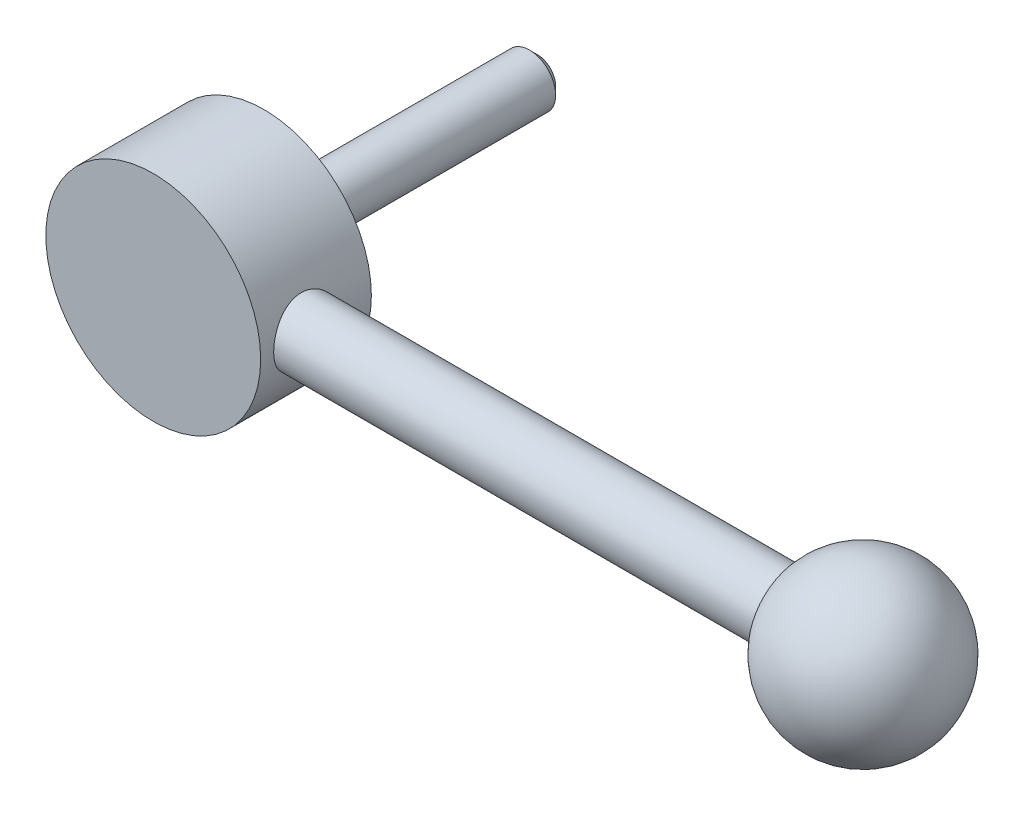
ISO-10303-21;
HEADER;
FILE_DESCRIPTION(('STEP AP214'),'2;1');
FILE_NAME('part.step','',(''),(''),'','','');
FILE_SCHEMA(('AUTOMOTIVE_DESIGN { 1 0 10303 214 1 1 1 1 }'));
ENDSEC;
DATA;
#1=APPLICATION_CONTEXT('core data for automotive mechanical design processes');
#2=APPLICATION_PROTOCOL_DEFINITION('international standard','automotive_design',2000,#1);
#3=PRODUCT_CONTEXT('',#1,'mechanical');
#4=PRODUCT('Part','Part','',(#3));
#5=PRODUCT_RELATED_PRODUCT_CATEGORY('part','',(#4));
#6=PRODUCT_DEFINITION_FORMATION('','',#4);
#7=PRODUCT_DEFINITION_CONTEXT('part definition',#1,'design');
#8=PRODUCT_DEFINITION('design','',#6,#7);
#9=PRODUCT_DEFINITION_SHAPE('','',#8);
#10=(LENGTH_UNIT() NAMED_UNIT(*) SI_UNIT(.MILLI.,.METRE.));
#11=(NAMED_UNIT(*) PLANE_ANGLE_UNIT() SI_UNIT($,.RADIAN.));
#12=(NAMED_UNIT(*) SI_UNIT($,.STERADIAN.) SOLID_ANGLE_UNIT());
#13=UNCERTAINTY_MEASURE_WITH_UNIT(LENGTH_MEASURE(1.E-05),#10,'distance_accuracy_value','');
#14=(GEOMETRIC_REPRESENTATION_CONTEXT(3) GLOBAL_UNCERTAINTY_ASSIGNED_CONTEXT((#13)) GLOBAL_UNIT_ASSIGNED_CONTEXT((#10,
#11,#12)) REPRESENTATION_CONTEXT('',''));
#15=CARTESIAN_POINT('',(0.,0.,0.));
#16=DIRECTION('',(0.,0.,1.));
#17=DIRECTION('',(1.,0.,0.));
#18=AXIS2_PLACEMENT_3D('',#15,#16,#17);
#19=CARTESIAN_POINT('',(0.,0.,40.));
#20=DIRECTION('',(0.,0.,1.));
#21=DIRECTION('',(1.,0.,0.));
#22=AXIS2_PLACEMENT_3D('',#19,#20,#21);
#23=CYLINDRICAL_SURFACE('',#22,6.75);
#24=CARTESIAN_POINT('',(0.,0.,2.));
#25=DIRECTION('',(0.,0.,1.));
#26=DIRECTION('',(1.,0.,0.));
#27=AXIS2_PLACEMENT_3D('',#24,#25,#26);
#28=CIRCLE('',#27,6.75);
#29=CARTESIAN_POINT('',(6.75,0.,2.));
#30=VERTEX_POINT('',#29);
#31=EDGE_CURVE('E23',#30,#30,#28,.T.);
#32=ORIENTED_EDGE('',*,*,#31,.F.);
#33=EDGE_LOOP('',(#32));
#34=FACE_BOUND('',#33,.T.);
#35=CARTESIAN_POINT('',(0.,0.,0.));
#36=DIRECTION('',(0.,0.,1.));
#37=DIRECTION('',(1.,0.,0.));
#38=AXIS2_PLACEMENT_3D('',#35,#36,#37);
#39=CIRCLE('',#38,6.75);
#40=CARTESIAN_POINT('',(6.75,0.,0.));
#41=VERTEX_POINT('',#40);
#42=EDGE_CURVE('E37',#41,#41,#39,.T.);
#43=ORIENTED_EDGE('',*,*,#42,.T.);
#44=EDGE_LOOP('',(#43));
#45=FACE_BOUND('',#44,.T.);
#46=ADVANCED_FACE('F12',(#34,#45),#23,.T.);
#47=CARTESIAN_POINT('',(6.75,0.,2.));
#48=DIRECTION('',(0.,0.,1.));
#49=DIRECTION('',(1.,0.,0.));
#50=AXIS2_PLACEMENT_3D('',#47,#48,#49);
#51=PLANE('',#50);
#52=CARTESIAN_POINT('',(0.,0.,2.));
#53=DIRECTION('',(0.,0.,1.));
#54=DIRECTION('',(1.,0.,0.));
#55=AXIS2_PLACEMENT_3D('',#52,#53,#54);
#56=CIRCLE('',#55,16.5);
#57=CARTESIAN_POINT('',(16.5,0.,2.));
#58=VERTEX_POINT('',#57);
#59=EDGE_CURVE('E27',#58,#58,#56,.T.);
#60=ORIENTED_EDGE('',*,*,#59,.F.);
#61=EDGE_LOOP('',(#60));
#62=FACE_BOUND('',#61,.T.);
#63=ORIENTED_EDGE('',*,*,#31,.T.);
#64=EDGE_LOOP('',(#63));
#65=FACE_BOUND('',#64,.T.);
#66=ADVANCED_FACE('F68',(#62,#65),#51,.F.);
#67=CARTESIAN_POINT('',(0.,0.,40.));
#68=DIRECTION('',(0.,0.,1.));
#69=DIRECTION('',(1.,0.,0.));
#70=AXIS2_PLACEMENT_3D('',#67,#68,#69);
#71=CYLINDRICAL_SURFACE('',#70,16.5);
#72=CARTESIAN_POINT('',(16.5,0.,7.));
#73=CARTESIAN_POINT('',(16.499997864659,-0.27416656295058,7.00000297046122));
#74=CARTESIAN_POINT('',(16.493101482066,-0.548363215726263,7.02262484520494));
#75=CARTESIAN_POINT('',(16.4662646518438,-1.08876356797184,7.11229452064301));
#76=CARTESIAN_POINT('',(16.446320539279,-1.35496499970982,7.17935480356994));
#77=CARTESIAN_POINT('',(16.3955720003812,-1.87150278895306,7.35545075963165));
#78=CARTESIAN_POINT('',(16.3647837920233,-2.12186218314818,7.4644237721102));
#79=CARTESIAN_POINT('',(16.2955420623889,-2.60075521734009,7.72099257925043));
#80=CARTESIAN_POINT('',(16.2570874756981,-2.82928581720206,7.86859374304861));
#81=CARTESIAN_POINT('',(16.1753529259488,-3.26471495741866,8.20277426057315));
#82=CARTESIAN_POINT('',(16.1319725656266,-3.47088543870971,8.39027763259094));
#83=CARTESIAN_POINT('',(16.0458704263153,-3.84938917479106,8.79697111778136));
#84=CARTESIAN_POINT('',(16.003148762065,-4.02171659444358,9.0161666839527));
#85=CARTESIAN_POINT('',(15.9221353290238,-4.33150150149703,9.48621682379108));
#86=CARTESIAN_POINT('',(15.8839681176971,-4.46806535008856,9.73768383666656));
#87=CARTESIAN_POINT('',(15.8178878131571,-4.69666762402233,10.2613575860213));
#88=CARTESIAN_POINT('',(15.7899722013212,-4.78871698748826,10.5335592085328));
#89=CARTESIAN_POINT('',(15.748602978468,-4.92304273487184,11.0827901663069));
#90=CARTESIAN_POINT('',(15.7347597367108,-4.96666335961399,11.3594605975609));
#91=CARTESIAN_POINT('',(15.7219440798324,-5.00709144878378,11.9165124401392));
#92=CARTESIAN_POINT('',(15.7229679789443,-5.00391051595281,12.1968929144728));
#93=CARTESIAN_POINT('',(15.7394259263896,-4.95188056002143,12.7424297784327));
#94=CARTESIAN_POINT('',(15.7543266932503,-4.90472150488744,13.0077661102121));
#95=CARTESIAN_POINT('',(15.7959958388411,-4.76880670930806,13.5265684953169));
#96=CARTESIAN_POINT('',(15.8227654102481,-4.68004678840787,13.7800333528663));
#97=CARTESIAN_POINT('',(15.8855774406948,-4.46221737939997,14.2720056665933));
#98=CARTESIAN_POINT('',(15.9217437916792,-4.33260397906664,14.5102558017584));
#99=CARTESIAN_POINT('',(15.9992154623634,-4.03712482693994,14.9621878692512));
#100=CARTESIAN_POINT('',(16.0405220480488,-3.87125013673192,15.1758637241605));
#101=CARTESIAN_POINT('',(16.125777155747,-3.49958783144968,15.5821595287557));
#102=CARTESIAN_POINT('',(16.1697632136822,-3.29239951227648,15.7734925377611));
#103=CARTESIAN_POINT('',(16.2538615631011,-2.84832978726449,16.1190003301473));
#104=CARTESIAN_POINT('',(16.2939736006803,-2.61144643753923,16.2731726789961));
#105=CARTESIAN_POINT('',(16.3661834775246,-2.11233821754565,16.540785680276));
#106=CARTESIAN_POINT('',(16.3982236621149,-1.84994861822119,16.6539357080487));
#107=CARTESIAN_POINT('',(16.4502641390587,-1.30866646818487,16.8341173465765));
#108=CARTESIAN_POINT('',(16.4702678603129,-1.02977864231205,16.9011620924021));
#109=CARTESIAN_POINT('',(16.4954369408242,-0.474353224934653,16.985075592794));
#110=CARTESIAN_POINT('',(16.5011177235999,-0.198102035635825,17.0036880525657));
#111=CARTESIAN_POINT('',(16.4985159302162,0.353597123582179,16.99510293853));
#112=CARTESIAN_POINT('',(16.4902352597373,0.629045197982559,16.9679116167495));
#113=CARTESIAN_POINT('',(16.4609787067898,1.16470330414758,16.869898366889));
#114=CARTESIAN_POINT('',(16.4403007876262,1.42511840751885,16.8000997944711));
#115=CARTESIAN_POINT('',(16.388649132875,1.93048096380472,16.6200887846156));
#116=CARTESIAN_POINT('',(16.3576741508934,2.17542653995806,16.5098714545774));
#117=CARTESIAN_POINT('',(16.2877277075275,2.64927766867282,16.2492534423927));
#118=CARTESIAN_POINT('',(16.2485858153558,2.87767261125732,16.097971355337));
#119=CARTESIAN_POINT('',(16.1667951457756,3.30642612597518,15.7605859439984));
#120=CARTESIAN_POINT('',(16.1241454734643,3.50677750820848,15.5744737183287));
#121=CARTESIAN_POINT('',(16.0381606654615,3.88146430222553,15.1645160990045));
#122=CARTESIAN_POINT('',(15.9948588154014,4.05455854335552,14.9395268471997));
#123=CARTESIAN_POINT('',(15.9141467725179,4.36062787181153,14.4627539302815));
#124=CARTESIAN_POINT('',(15.8767364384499,4.49360392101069,14.2109709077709));
#125=CARTESIAN_POINT('',(15.8124706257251,4.71477026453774,13.6884965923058));
#126=CARTESIAN_POINT('',(15.7855679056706,4.80316154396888,13.4178965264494));
#127=CARTESIAN_POINT('',(15.7455304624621,4.93284562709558,12.8646819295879));
#128=CARTESIAN_POINT('',(15.732390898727,4.97415499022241,12.5820716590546));
#129=CARTESIAN_POINT('',(15.7218509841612,5.00736143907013,12.0257720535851));
#130=CARTESIAN_POINT('',(15.7238051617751,5.00128483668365,11.7522143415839));
#131=CARTESIAN_POINT('',(15.7416767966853,4.94474176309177,11.2102140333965));
#132=CARTESIAN_POINT('',(15.7575936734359,4.89427713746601,10.9417712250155));
#133=CARTESIAN_POINT('',(15.8011599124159,4.75171037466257,10.4210074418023));
#134=CARTESIAN_POINT('',(15.8286548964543,4.66015510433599,10.1685228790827));
#135=CARTESIAN_POINT('',(15.8922482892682,4.43843275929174,9.68229661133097));
#136=CARTESIAN_POINT('',(15.9283483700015,4.30825817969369,9.44855856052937));
#137=CARTESIAN_POINT('',(16.0067548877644,4.00734203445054,8.99708364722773));
#138=CARTESIAN_POINT('',(16.0492418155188,3.83527527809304,8.78026142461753));
#139=CARTESIAN_POINT('',(16.1347696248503,3.45783157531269,8.3779118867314));
#140=CARTESIAN_POINT('',(16.1778106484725,3.25244592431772,8.19239277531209));
#141=CARTESIAN_POINT('',(16.2611473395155,2.80676565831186,7.85235596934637));
#142=CARTESIAN_POINT('',(16.301321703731,2.56560775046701,7.69893691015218));
#143=CARTESIAN_POINT('',(16.3729264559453,2.05970384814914,7.43503282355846));
#144=CARTESIAN_POINT('',(16.4043607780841,1.79496853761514,7.32452847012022));
#145=CARTESIAN_POINT('',(16.4523310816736,1.27725626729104,7.15905013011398));
#146=CARTESIAN_POINT('',(16.4700574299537,1.02582323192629,7.09957036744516));
#147=CARTESIAN_POINT('',(16.4938918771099,0.516268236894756,7.02004735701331));
#148=CARTESIAN_POINT('',(16.5000020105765,0.258147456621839,6.999997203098));
#149=CARTESIAN_POINT('',(16.5,0.,7.));
#150=B_SPLINE_CURVE_WITH_KNOTS('',3,(#72,#73,#74,#75,#76,#77,#78,#79,#80,#81,#82,#83,#84,#85,
#86,#87,#88,#89,#90,#91,#92,#93,#94,#95,#96,#97,#98,#99,#100,#101,#102,#103,#104,#105,#106,#107,
#108,#109,#110,#111,#112,#113,#114,#115,#116,#117,#118,#119,#120,#121,#122,#123,#124,#125,#126,
#127,#128,#129,#130,#131,#132,#133,#134,#135,#136,#137,#138,#139,#140,#141,#142,#143,#144,#145,
#146,#147,#148,#149),.UNSPECIFIED.,.T.,.F.,(4,2,2,2,2,2,2,2,2,2,2,2,2,2,2,2,2,2,2,2,2,2,2,2,2,2,
2,2,2,2,2,2,2,2,2,2,2,2,4),(0.,0.82155130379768,1.64333346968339,2.46389179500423,
3.28456423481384,4.12684629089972,4.96927344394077,5.83108565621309,6.69268599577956,
7.52972147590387,8.36654944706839,9.1724896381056,9.97851083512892,10.7957518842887,
11.6131946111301,12.4655059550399,13.3178731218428,14.1761660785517,15.0342144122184,
15.8609136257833,16.6875000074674,17.49497421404,18.302546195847,19.1290491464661,
19.9557636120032,20.8131534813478,21.6705227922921,22.5239918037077,23.3771605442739,
24.194052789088,25.0109110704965,25.8172062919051,26.6236583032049,27.4600121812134,
28.2965849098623,29.1582870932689,30.0196007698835,30.7932856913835,31.5668350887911),.UNSPECIFIED.);
#151=CARTESIAN_POINT('',(16.5,0.,7.));
#152=VERTEX_POINT('',#151);
#153=EDGE_CURVE('E30',#152,#152,#150,.T.);
#154=ORIENTED_EDGE('',*,*,#153,.T.);
#155=EDGE_LOOP('',(#154));
#156=FACE_BOUND('',#155,.T.);
#157=CARTESIAN_POINT('',(0.,0.,19.));
#158=DIRECTION('',(0.,0.,1.));
#159=DIRECTION('',(1.,0.,0.));
#160=AXIS2_PLACEMENT_3D('',#157,#158,#159);
#161=CIRCLE('',#160,16.5);
#162=CARTESIAN_POINT('',(16.5,0.,19.));
#163=VERTEX_POINT('',#162);
#164=EDGE_CURVE('E85',#163,#163,#161,.T.);
#165=ORIENTED_EDGE('',*,*,#164,.F.);
#166=EDGE_LOOP('',(#165));
#167=FACE_BOUND('',#166,.T.);
#168=ORIENTED_EDGE('',*,*,#59,.T.);
#169=EDGE_LOOP('',(#168));
#170=FACE_BOUND('',#169,.T.);
#171=ADVANCED_FACE('F40',(#156,#167,#170),#71,.T.);
#172=CARTESIAN_POINT('',(16.5,0.,19.));
#173=DIRECTION('',(0.,0.,-1.));
#174=DIRECTION('',(-1.,0.,0.));
#175=AXIS2_PLACEMENT_3D('',#172,#173,#174);
#176=PLANE('',#175);
#177=ORIENTED_EDGE('',*,*,#164,.T.);
#178=EDGE_LOOP('',(#177));
#179=FACE_BOUND('',#178,.T.);
#180=ADVANCED_FACE('F60',(#179),#176,.F.);
#181=CARTESIAN_POINT('',(4.,0.,-40.));
#182=DIRECTION('',(0.,0.,-1.));
#183=DIRECTION('',(-1.,0.,0.));
#184=AXIS2_PLACEMENT_3D('',#181,#182,#183);
#185=PLANE('',#184);
#186=CARTESIAN_POINT('',(0.,0.,-40.));
#187=DIRECTION('',(0.,0.,-1.));
#188=DIRECTION('',(-1.,0.,0.));
#189=AXIS2_PLACEMENT_3D('',#186,#187,#188);
#190=CIRCLE('',#189,2.8);
#191=CARTESIAN_POINT('',(-2.8,0.,-40.));
#192=VERTEX_POINT('',#191);
#193=EDGE_CURVE('E8',#192,#192,#190,.T.);
#194=ORIENTED_EDGE('',*,*,#193,.T.);
#195=EDGE_LOOP('',(#194));
#196=FACE_BOUND('',#195,.T.);
#197=ADVANCED_FACE('F58',(#196),#185,.T.);
#198=CARTESIAN_POINT('',(0.,0.,40.));
#199=DIRECTION('',(0.,0.,1.));
#200=DIRECTION('',(1.,0.,0.));
#201=AXIS2_PLACEMENT_3D('',#198,#199,#200);
#202=CYLINDRICAL_SURFACE('',#201,4.);
#203=CARTESIAN_POINT('',(0.,0.,-38.8));
#204=DIRECTION('',(0.,0.,-1.));
#205=DIRECTION('',(-1.,0.,0.));
#206=AXIS2_PLACEMENT_3D('',#203,#204,#205);
#207=CIRCLE('',#206,4.);
#208=CARTESIAN_POINT('',(-4.,0.,-38.8));
#209=VERTEX_POINT('',#208);
#210=EDGE_CURVE('E19',#209,#209,#207,.F.);
#211=ORIENTED_EDGE('',*,*,#210,.T.);
#212=EDGE_LOOP('',(#211));
#213=FACE_BOUND('',#212,.T.);
#214=CARTESIAN_POINT('',(0.,0.,0.));
#215=DIRECTION('',(0.,0.,1.));
#216=DIRECTION('',(1.,0.,0.));
#217=AXIS2_PLACEMENT_3D('',#214,#215,#216);
#218=CIRCLE('',#217,4.);
#219=CARTESIAN_POINT('',(4.,0.,0.));
#220=VERTEX_POINT('',#219);
#221=EDGE_CURVE('E82',#220,#220,#218,.T.);
#222=ORIENTED_EDGE('',*,*,#221,.F.);
#223=EDGE_LOOP('',(#222));
#224=FACE_BOUND('',#223,.T.);
#225=ADVANCED_FACE('F54',(#213,#224),#202,.T.);
#226=CARTESIAN_POINT('',(4.,0.,0.));
#227=DIRECTION('',(0.,0.,1.));
#228=DIRECTION('',(1.,0.,0.));
#229=AXIS2_PLACEMENT_3D('',#226,#227,#228);
#230=PLANE('',#229);
#231=ORIENTED_EDGE('',*,*,#42,.F.);
#232=EDGE_LOOP('',(#231));
#233=FACE_BOUND('',#232,.T.);
#234=ORIENTED_EDGE('',*,*,#221,.T.);
#235=EDGE_LOOP('',(#234));
#236=FACE_BOUND('',#235,.T.);
#237=ADVANCED_FACE('F50',(#233,#236),#230,.F.);
#238=CARTESIAN_POINT('',(-30.,0.,12.));
#239=DIRECTION('',(-1.,0.,0.));
#240=DIRECTION('',(0.,0.,1.));
#241=AXIS2_PLACEMENT_3D('',#238,#239,#240);
#242=CYLINDRICAL_SURFACE('',#241,5.);
#243=CARTESIAN_POINT('',(90.5435607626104,0.,12.));
#244=DIRECTION('',(-1.,0.,0.));
#245=DIRECTION('',(0.,0.,1.));
#246=AXIS2_PLACEMENT_3D('',#243,#244,#245);
#247=CIRCLE('',#246,5.);
#248=CARTESIAN_POINT('',(90.5435607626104,0.,17.));
#249=VERTEX_POINT('',#248);
#250=EDGE_CURVE('E38',#249,#249,#247,.T.);
#251=ORIENTED_EDGE('',*,*,#250,.T.);
#252=EDGE_LOOP('',(#251));
#253=FACE_BOUND('',#252,.T.);
#254=ORIENTED_EDGE('',*,*,#153,.F.);
#255=EDGE_LOOP('',(#254));
#256=FACE_BOUND('',#255,.T.);
#257=ADVANCED_FACE('F44',(#253,#256),#242,.T.);
#258=CARTESIAN_POINT('',(102.,0.,12.));
#259=DIRECTION('',(0.,0.,1.));
#260=DIRECTION('',(1.,0.,0.));
#261=AXIS2_PLACEMENT_3D('',#258,#259,#260);
#262=SPHERICAL_SURFACE('',#261,12.5);
#263=CARTESIAN_POINT('',(102.,0.,12.));
#264=DIRECTION('',(-1.,0.,0.));
#265=DIRECTION('',(0.,0.,1.));
#266=AXIS2_PLACEMENT_3D('',#263,#264,#265);
#267=SPHERICAL_SURFACE('',#266,12.5);
#268=ORIENTED_EDGE('',*,*,#250,.F.);
#269=EDGE_LOOP('',(#268));
#270=FACE_BOUND('',#269,.T.);
#271=ADVANCED_FACE('F49',(#270),#267,.T.);
#272=CARTESIAN_POINT('',(0.,0.,-38.8));
#273=DIRECTION('',(0.,0.,1.));
#274=DIRECTION('',(1.,0.,0.));
#275=AXIS2_PLACEMENT_3D('',#272,#273,#274);
#276=CONICAL_SURFACE('',#275,4.,0.785398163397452);
#277=ORIENTED_EDGE('',*,*,#193,.F.);
#278=EDGE_LOOP('',(#277));
#279=FACE_BOUND('',#278,.T.);
#280=ORIENTED_EDGE('',*,*,#210,.F.);
#281=EDGE_LOOP('',(#280));
#282=FACE_BOUND('',#281,.T.);
#283=ADVANCED_FACE('F14',(#279,#282),#276,.T.);
#284=CLOSED_SHELL('',(#46,#66,#171,#180,#197,#225,#237,#257,#271,#283));
#285=MANIFOLD_SOLID_BREP('B1',#284);
#286=ADVANCED_BREP_SHAPE_REPRESENTATION('',(#18,#285),#14);
#287=SHAPE_DEFINITION_REPRESENTATION(#9,#286);
ENDSEC;
END-ISO-10303-21;
